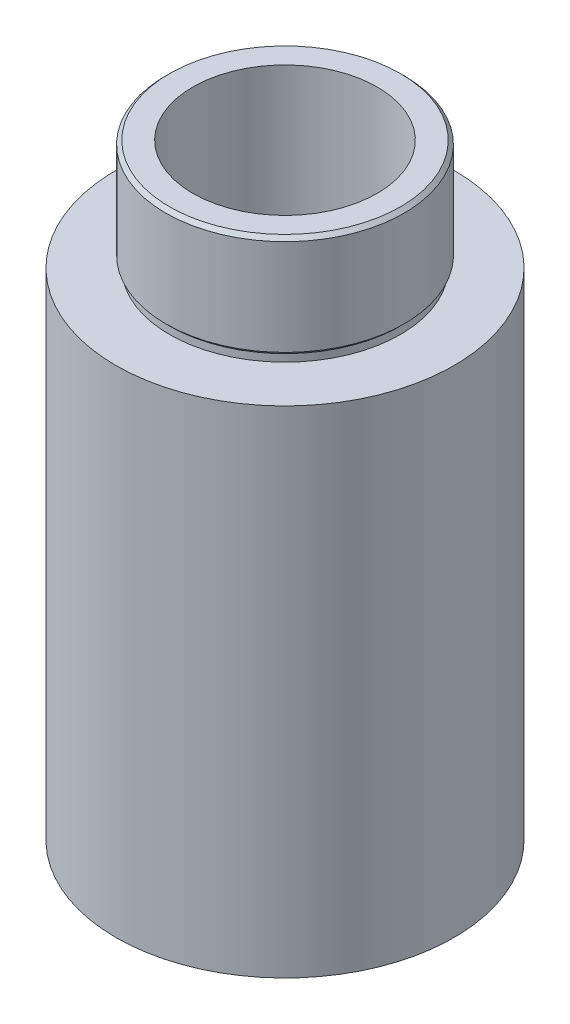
ISO-10303-21;
HEADER;
FILE_DESCRIPTION(('STEP AP214'),'2;1');
FILE_NAME('part.step','',(''),(''),'','','');
FILE_SCHEMA(('AUTOMOTIVE_DESIGN { 1 0 10303 214 1 1 1 1 }'));
ENDSEC;
DATA;
#1=APPLICATION_CONTEXT('core data for automotive mechanical design processes');
#2=APPLICATION_PROTOCOL_DEFINITION('international standard','automotive_design',2000,#1);
#3=PRODUCT_CONTEXT('',#1,'mechanical');
#4=PRODUCT('Part','Part','',(#3));
#5=PRODUCT_RELATED_PRODUCT_CATEGORY('part','',(#4));
#6=PRODUCT_DEFINITION_FORMATION('','',#4);
#7=PRODUCT_DEFINITION_CONTEXT('part definition',#1,'design');
#8=PRODUCT_DEFINITION('design','',#6,#7);
#9=PRODUCT_DEFINITION_SHAPE('','',#8);
#10=(LENGTH_UNIT() NAMED_UNIT(*) SI_UNIT(.MILLI.,.METRE.));
#11=(NAMED_UNIT(*) PLANE_ANGLE_UNIT() SI_UNIT($,.RADIAN.));
#12=(NAMED_UNIT(*) SI_UNIT($,.STERADIAN.) SOLID_ANGLE_UNIT());
#13=UNCERTAINTY_MEASURE_WITH_UNIT(LENGTH_MEASURE(1.E-05),#10,'distance_accuracy_value','');
#14=(GEOMETRIC_REPRESENTATION_CONTEXT(3) GLOBAL_UNCERTAINTY_ASSIGNED_CONTEXT((#13)) GLOBAL_UNIT_ASSIGNED_CONTEXT((#10,
#11,#12)) REPRESENTATION_CONTEXT('',''));
#15=CARTESIAN_POINT('',(0.,0.,0.));
#16=DIRECTION('',(0.,0.,1.));
#17=DIRECTION('',(1.,0.,0.));
#18=AXIS2_PLACEMENT_3D('',#15,#16,#17);
#19=CARTESIAN_POINT('',(41.6649122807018,222.25089122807,-1.8812569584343E-12));
#20=DIRECTION('',(0.,-1.,0.));
#21=DIRECTION('',(0.,0.,-1.));
#22=AXIS2_PLACEMENT_3D('',#19,#20,#21);
#23=CYLINDRICAL_SURFACE('',#22,10.795);
#24=CARTESIAN_POINT('',(41.6649122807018,227.73729122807,-1.8812569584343E-12));
#25=DIRECTION('',(0.,-1.,0.));
#26=DIRECTION('',(0.,0.,-1.));
#27=AXIS2_PLACEMENT_3D('',#24,#25,#26);
#28=CIRCLE('',#27,10.795);
#29=CARTESIAN_POINT('',(41.6649122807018,227.73729122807,-10.7950000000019));
#30=VERTEX_POINT('',#29);
#31=EDGE_CURVE('E77',#30,#30,#28,.T.);
#32=ORIENTED_EDGE('',*,*,#31,.T.);
#33=EDGE_LOOP('',(#32));
#34=FACE_BOUND('',#33,.T.);
#35=CARTESIAN_POINT('',(41.6649122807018,269.43774122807,-1.8812569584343E-12));
#36=DIRECTION('',(0.,1.,0.));
#37=DIRECTION('',(0.,0.,1.));
#38=AXIS2_PLACEMENT_3D('',#35,#36,#37);
#39=CIRCLE('',#38,10.795);
#40=CARTESIAN_POINT('',(41.6649122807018,269.43774122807,10.7949999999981));
#41=VERTEX_POINT('',#40);
#42=EDGE_CURVE('E107',#41,#41,#39,.F.);
#43=ORIENTED_EDGE('',*,*,#42,.F.);
#44=EDGE_LOOP('',(#43));
#45=FACE_BOUND('',#44,.T.);
#46=ADVANCED_FACE('F42',(#34,#45),#23,.F.);
#47=CARTESIAN_POINT('',(41.6649122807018,223.816525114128,-1.8812569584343E-12));
#48=DIRECTION('',(0.,-1.,0.));
#49=DIRECTION('',(0.,0.,-1.));
#50=AXIS2_PLACEMENT_3D('',#47,#48,#49);
#51=CONICAL_SURFACE('',#50,11.8455661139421,0.26179938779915);
#52=ORIENTED_EDGE('',*,*,#31,.F.);
#53=EDGE_LOOP('',(#52));
#54=FACE_BOUND('',#53,.T.);
#55=CARTESIAN_POINT('',(41.6649122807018,223.816525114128,-1.8812569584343E-12));
#56=DIRECTION('',(0.,-1.,0.));
#57=DIRECTION('',(0.,0.,-1.));
#58=AXIS2_PLACEMENT_3D('',#55,#56,#57);
#59=CIRCLE('',#58,11.8455661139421);
#60=CARTESIAN_POINT('',(41.6649122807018,223.816525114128,-11.845566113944));
#61=VERTEX_POINT('',#60);
#62=EDGE_CURVE('E84',#61,#61,#59,.T.);
#63=ORIENTED_EDGE('',*,*,#62,.T.);
#64=EDGE_LOOP('',(#63));
#65=FACE_BOUND('',#64,.T.);
#66=ADVANCED_FACE('F115',(#54,#65),#51,.F.);
#67=CARTESIAN_POINT('',(41.6649122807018,222.25089122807,-1.8812569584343E-12));
#68=DIRECTION('',(0.,-1.,0.));
#69=DIRECTION('',(0.,0.,-1.));
#70=AXIS2_PLACEMENT_3D('',#67,#68,#69);
#71=CONICAL_SURFACE('',#70,13.4112,0.78539816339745);
#72=ORIENTED_EDGE('',*,*,#62,.F.);
#73=EDGE_LOOP('',(#72));
#74=FACE_BOUND('',#73,.T.);
#75=CARTESIAN_POINT('',(41.6649122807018,222.25089122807,-1.8812569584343E-12));
#76=DIRECTION('',(0.,-1.,0.));
#77=DIRECTION('',(0.,0.,-1.));
#78=AXIS2_PLACEMENT_3D('',#75,#76,#77);
#79=CIRCLE('',#78,13.4112);
#80=CARTESIAN_POINT('',(41.6649122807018,222.25089122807,-13.4112000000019));
#81=VERTEX_POINT('',#80);
#82=EDGE_CURVE('E96',#81,#81,#79,.F.);
#83=ORIENTED_EDGE('',*,*,#82,.F.);
#84=EDGE_LOOP('',(#83));
#85=FACE_BOUND('',#84,.T.);
#86=ADVANCED_FACE('F121',(#74,#85),#71,.F.);
#87=CARTESIAN_POINT('',(41.6649122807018,222.25089122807,-1.8812569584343E-12));
#88=DIRECTION('',(0.,-1.,0.));
#89=DIRECTION('',(0.,0.,-1.));
#90=AXIS2_PLACEMENT_3D('',#87,#88,#89);
#91=PLANE('',#90);
#92=CARTESIAN_POINT('',(41.6649122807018,222.25089122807,-1.88258332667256E-12));
#93=DIRECTION('',(0.,-1.,0.));
#94=DIRECTION('',(0.,0.,-1.));
#95=AXIS2_PLACEMENT_3D('',#92,#93,#94);
#96=CIRCLE('',#95,14.0716);
#97=CARTESIAN_POINT('',(41.6649122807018,222.25089122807,-14.0716000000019));
#98=VERTEX_POINT('',#97);
#99=EDGE_CURVE('E100',#98,#98,#96,.F.);
#100=ORIENTED_EDGE('',*,*,#99,.F.);
#101=EDGE_LOOP('',(#100));
#102=FACE_BOUND('',#101,.T.);
#103=ORIENTED_EDGE('',*,*,#82,.T.);
#104=EDGE_LOOP('',(#103));
#105=FACE_BOUND('',#104,.T.);
#106=ADVANCED_FACE('F148',(#102,#105),#91,.T.);
#107=CARTESIAN_POINT('',(55.7365122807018,221.43174122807,-1.88258332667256E-12));
#108=DIRECTION('',(0.,1.,0.));
#109=DIRECTION('',(0.,0.,1.));
#110=AXIS2_PLACEMENT_3D('',#107,#108,#109);
#111=PLANE('',#110);
#112=CARTESIAN_POINT('',(41.6649122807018,221.43174122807,-1.88258332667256E-12));
#113=DIRECTION('',(0.,1.,0.));
#114=DIRECTION('',(0.,0.,1.));
#115=AXIS2_PLACEMENT_3D('',#112,#113,#114);
#116=CIRCLE('',#115,14.0716);
#117=CARTESIAN_POINT('',(41.6649122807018,221.43174122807,14.0715999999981));
#118=VERTEX_POINT('',#117);
#119=EDGE_CURVE('E92',#118,#118,#116,.T.);
#120=ORIENTED_EDGE('',*,*,#119,.T.);
#121=EDGE_LOOP('',(#120));
#122=FACE_BOUND('',#121,.T.);
#123=CARTESIAN_POINT('',(41.6649122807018,221.43174122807,-1.88258332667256E-12));
#124=DIRECTION('',(0.,1.,0.));
#125=DIRECTION('',(0.,0.,1.));
#126=AXIS2_PLACEMENT_3D('',#123,#124,#125);
#127=CIRCLE('',#126,17.4625);
#128=CARTESIAN_POINT('',(41.6649122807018,221.43174122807,17.4624999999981));
#129=VERTEX_POINT('',#128);
#130=EDGE_CURVE('E63',#129,#129,#127,.T.);
#131=ORIENTED_EDGE('',*,*,#130,.F.);
#132=EDGE_LOOP('',(#131));
#133=FACE_BOUND('',#132,.T.);
#134=ADVANCED_FACE('F145',(#122,#133),#111,.F.);
#135=CARTESIAN_POINT('',(41.6649122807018,302.710460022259,-1.88258332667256E-12));
#136=DIRECTION('',(0.,1.,0.));
#137=DIRECTION('',(0.,0.,1.));
#138=AXIS2_PLACEMENT_3D('',#135,#136,#137);
#139=CYLINDRICAL_SURFACE('',#138,17.4625);
#140=CARTESIAN_POINT('',(41.6649122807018,272.61274122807,-1.88258332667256E-12));
#141=DIRECTION('',(0.,1.,0.));
#142=DIRECTION('',(0.,0.,1.));
#143=AXIS2_PLACEMENT_3D('',#140,#141,#142);
#144=CIRCLE('',#143,17.4625);
#145=CARTESIAN_POINT('',(41.6649122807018,272.61274122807,17.4624999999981));
#146=VERTEX_POINT('',#145);
#147=EDGE_CURVE('E69',#146,#146,#144,.T.);
#148=ORIENTED_EDGE('',*,*,#147,.F.);
#149=EDGE_LOOP('',(#148));
#150=FACE_BOUND('',#149,.T.);
#151=ORIENTED_EDGE('',*,*,#130,.T.);
#152=EDGE_LOOP('',(#151));
#153=FACE_BOUND('',#152,.T.);
#154=ADVANCED_FACE('F141',(#150,#153),#139,.T.);
#155=CARTESIAN_POINT('',(56.6515399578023,272.61274122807,-1.88258332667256E-12));
#156=DIRECTION('',(0.,-1.,0.));
#157=DIRECTION('',(0.,0.,-1.));
#158=AXIS2_PLACEMENT_3D('',#155,#156,#157);
#159=PLANE('',#158);
#160=ORIENTED_EDGE('',*,*,#147,.T.);
#161=EDGE_LOOP('',(#160));
#162=FACE_BOUND('',#161,.T.);
#163=CARTESIAN_POINT('',(41.6649122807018,272.61274122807,-1.88258332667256E-12));
#164=DIRECTION('',(0.,1.,0.));
#165=DIRECTION('',(0.,0.,1.));
#166=AXIS2_PLACEMENT_3D('',#163,#164,#165);
#167=CIRCLE('',#166,11.9253);
#168=CARTESIAN_POINT('',(41.6649122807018,272.61274122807,-11.9253000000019));
#169=VERTEX_POINT('',#168);
#170=EDGE_CURVE('E73',#169,#169,#167,.T.);
#171=ORIENTED_EDGE('',*,*,#170,.F.);
#172=EDGE_LOOP('',(#171));
#173=FACE_BOUND('',#172,.T.);
#174=ADVANCED_FACE('F138',(#162,#173),#159,.F.);
#175=CARTESIAN_POINT('',(41.6649122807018,302.710460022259,-1.88258332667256E-12));
#176=DIRECTION('',(0.,1.,0.));
#177=DIRECTION('',(0.,0.,1.));
#178=AXIS2_PLACEMENT_3D('',#175,#176,#177);
#179=CYLINDRICAL_SURFACE('',#178,12.3063);
#180=CARTESIAN_POINT('',(41.6649122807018,283.66174122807,-1.88258332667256E-12));
#181=DIRECTION('',(0.,-1.,0.));
#182=DIRECTION('',(0.,0.,-1.));
#183=AXIS2_PLACEMENT_3D('',#180,#181,#182);
#184=CIRCLE('',#183,12.3063);
#185=CARTESIAN_POINT('',(41.6649122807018,283.66174122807,-12.3063000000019));
#186=VERTEX_POINT('',#185);
#187=EDGE_CURVE('E10',#186,#186,#184,.T.);
#188=ORIENTED_EDGE('',*,*,#187,.T.);
#189=EDGE_LOOP('',(#188));
#190=FACE_BOUND('',#189,.T.);
#191=CARTESIAN_POINT('',(41.6649122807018,273.75574122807,-1.88258332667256E-12));
#192=DIRECTION('',(0.,1.,0.));
#193=DIRECTION('',(0.,0.,1.));
#194=AXIS2_PLACEMENT_3D('',#191,#192,#193);
#195=CIRCLE('',#194,12.3063);
#196=CARTESIAN_POINT('',(41.6649122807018,273.75574122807,12.3062999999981));
#197=VERTEX_POINT('',#196);
#198=EDGE_CURVE('E50',#197,#197,#195,.T.);
#199=ORIENTED_EDGE('',*,*,#198,.T.);
#200=EDGE_LOOP('',(#199));
#201=FACE_BOUND('',#200,.T.);
#202=ADVANCED_FACE('F134',(#190,#201),#179,.T.);
#203=CARTESIAN_POINT('',(51.1899122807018,284.04274122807,-1.88258332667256E-12));
#204=DIRECTION('',(0.,-1.,0.));
#205=DIRECTION('',(0.,0.,-1.));
#206=AXIS2_PLACEMENT_3D('',#203,#204,#205);
#207=PLANE('',#206);
#208=CARTESIAN_POINT('',(41.6649122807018,284.04274122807,-1.88258332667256E-12));
#209=DIRECTION('',(0.,1.,0.));
#210=DIRECTION('',(0.,0.,1.));
#211=AXIS2_PLACEMENT_3D('',#208,#209,#210);
#212=CIRCLE('',#211,9.525);
#213=CARTESIAN_POINT('',(41.6649122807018,284.04274122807,9.52499999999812));
#214=VERTEX_POINT('',#213);
#215=EDGE_CURVE('E88',#214,#214,#212,.T.);
#216=ORIENTED_EDGE('',*,*,#215,.F.);
#217=EDGE_LOOP('',(#216));
#218=FACE_BOUND('',#217,.T.);
#219=CARTESIAN_POINT('',(41.6649122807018,284.04274122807,-1.88258332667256E-12));
#220=DIRECTION('',(0.,-1.,0.));
#221=DIRECTION('',(0.,0.,-1.));
#222=AXIS2_PLACEMENT_3D('',#219,#220,#221);
#223=CIRCLE('',#222,11.9253);
#224=CARTESIAN_POINT('',(41.6649122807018,284.04274122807,-11.9253000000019));
#225=VERTEX_POINT('',#224);
#226=EDGE_CURVE('E57',#225,#225,#223,.F.);
#227=ORIENTED_EDGE('',*,*,#226,.T.);
#228=EDGE_LOOP('',(#227));
#229=FACE_BOUND('',#228,.T.);
#230=ADVANCED_FACE('F130',(#218,#229),#207,.F.);
#231=CARTESIAN_POINT('',(41.6649122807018,273.37474122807,-1.88258332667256E-12));
#232=DIRECTION('',(0.,-1.,0.));
#233=DIRECTION('',(0.,0.,-1.));
#234=AXIS2_PLACEMENT_3D('',#231,#232,#233);
#235=CYLINDRICAL_SURFACE('',#234,11.9253);
#236=CARTESIAN_POINT('',(41.6649122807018,273.37474122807,-1.88258332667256E-12));
#237=DIRECTION('',(0.,1.,0.));
#238=DIRECTION('',(0.,0.,1.));
#239=AXIS2_PLACEMENT_3D('',#236,#237,#238);
#240=CIRCLE('',#239,11.9253);
#241=CARTESIAN_POINT('',(41.6649122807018,273.37474122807,-11.9253000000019));
#242=VERTEX_POINT('',#241);
#243=EDGE_CURVE('E72',#242,#242,#240,.T.);
#244=CARTESIAN_POINT('',(41.6649122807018,273.37474122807,-11.9253000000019));
#245=CARTESIAN_POINT('',(41.6649122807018,273.36680372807,-11.9253000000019));
#246=CARTESIAN_POINT('',(41.6649122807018,273.35886622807,-11.9253000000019));
#247=CARTESIAN_POINT('',(41.6649122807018,273.34299122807,-11.9253000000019));
#248=CARTESIAN_POINT('',(41.6649122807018,273.33505372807,-11.9253000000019));
#249=CARTESIAN_POINT('',(41.6649122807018,273.31917872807,-11.9253000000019));
#250=CARTESIAN_POINT('',(41.6649122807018,273.31124122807,-11.9253000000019));
#251=CARTESIAN_POINT('',(41.6649122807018,273.29536622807,-11.9253000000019));
#252=CARTESIAN_POINT('',(41.6649122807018,273.28742872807,-11.9253000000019));
#253=CARTESIAN_POINT('',(41.6649122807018,273.27155372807,-11.9253000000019));
#254=CARTESIAN_POINT('',(41.6649122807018,273.26361622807,-11.9253000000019));
#255=CARTESIAN_POINT('',(41.6649122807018,273.24774122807,-11.9253000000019));
#256=CARTESIAN_POINT('',(41.6649122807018,273.23980372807,-11.9253000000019));
#257=CARTESIAN_POINT('',(41.6649122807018,273.22392872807,-11.9253000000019));
#258=CARTESIAN_POINT('',(41.6649122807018,273.21599122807,-11.9253000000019));
#259=CARTESIAN_POINT('',(41.6649122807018,273.20011622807,-11.9253000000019));
#260=CARTESIAN_POINT('',(41.6649122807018,273.19217872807,-11.9253000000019));
#261=CARTESIAN_POINT('',(41.6649122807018,273.17630372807,-11.9253000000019));
#262=CARTESIAN_POINT('',(41.6649122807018,273.16836622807,-11.9253000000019));
#263=CARTESIAN_POINT('',(41.6649122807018,273.15249122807,-11.9253000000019));
#264=CARTESIAN_POINT('',(41.6649122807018,273.14455372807,-11.9253000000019));
#265=CARTESIAN_POINT('',(41.6649122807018,273.12867872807,-11.9253000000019));
#266=CARTESIAN_POINT('',(41.6649122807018,273.12074122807,-11.9253000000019));
#267=CARTESIAN_POINT('',(41.6649122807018,273.10486622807,-11.9253000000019));
#268=CARTESIAN_POINT('',(41.6649122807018,273.09692872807,-11.9253000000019));
#269=CARTESIAN_POINT('',(41.6649122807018,273.08105372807,-11.9253000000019));
#270=CARTESIAN_POINT('',(41.6649122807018,273.07311622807,-11.9253000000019));
#271=CARTESIAN_POINT('',(41.6649122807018,273.05724122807,-11.9253000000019));
#272=CARTESIAN_POINT('',(41.6649122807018,273.04930372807,-11.9253000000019));
#273=CARTESIAN_POINT('',(41.6649122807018,273.03342872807,-11.9253000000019));
#274=CARTESIAN_POINT('',(41.6649122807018,273.02549122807,-11.9253000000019));
#275=CARTESIAN_POINT('',(41.6649122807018,273.00961622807,-11.9253000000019));
#276=CARTESIAN_POINT('',(41.6649122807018,273.00167872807,-11.9253000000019));
#277=CARTESIAN_POINT('',(41.6649122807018,272.98580372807,-11.9253000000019));
#278=CARTESIAN_POINT('',(41.6649122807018,272.97786622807,-11.9253000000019));
#279=CARTESIAN_POINT('',(41.6649122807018,272.96199122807,-11.9253000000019));
#280=CARTESIAN_POINT('',(41.6649122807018,272.95405372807,-11.9253000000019));
#281=CARTESIAN_POINT('',(41.6649122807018,272.93817872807,-11.9253000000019));
#282=CARTESIAN_POINT('',(41.6649122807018,272.93024122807,-11.9253000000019));
#283=CARTESIAN_POINT('',(41.6649122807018,272.91436622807,-11.9253000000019));
#284=CARTESIAN_POINT('',(41.6649122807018,272.90642872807,-11.9253000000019));
#285=CARTESIAN_POINT('',(41.6649122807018,272.89055372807,-11.9253000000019));
#286=CARTESIAN_POINT('',(41.6649122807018,272.88261622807,-11.9253000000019));
#287=CARTESIAN_POINT('',(41.6649122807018,272.86674122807,-11.9253000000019));
#288=CARTESIAN_POINT('',(41.6649122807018,272.85880372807,-11.9253000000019));
#289=CARTESIAN_POINT('',(41.6649122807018,272.84292872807,-11.9253000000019));
#290=CARTESIAN_POINT('',(41.6649122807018,272.83499122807,-11.9253000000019));
#291=CARTESIAN_POINT('',(41.6649122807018,272.81911622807,-11.9253000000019));
#292=CARTESIAN_POINT('',(41.6649122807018,272.81117872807,-11.9253000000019));
#293=CARTESIAN_POINT('',(41.6649122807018,272.79530372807,-11.9253000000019));
#294=CARTESIAN_POINT('',(41.6649122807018,272.78736622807,-11.9253000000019));
#295=CARTESIAN_POINT('',(41.6649122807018,272.77149122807,-11.9253000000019));
#296=CARTESIAN_POINT('',(41.6649122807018,272.76355372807,-11.9253000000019));
#297=CARTESIAN_POINT('',(41.6649122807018,272.74767872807,-11.9253000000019));
#298=CARTESIAN_POINT('',(41.6649122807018,272.73974122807,-11.9253000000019));
#299=CARTESIAN_POINT('',(41.6649122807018,272.72386622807,-11.9253000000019));
#300=CARTESIAN_POINT('',(41.6649122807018,272.71592872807,-11.9253000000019));
#301=CARTESIAN_POINT('',(41.6649122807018,272.70005372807,-11.9253000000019));
#302=CARTESIAN_POINT('',(41.6649122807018,272.69211622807,-11.9253000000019));
#303=CARTESIAN_POINT('',(41.6649122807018,272.67624122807,-11.9253000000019));
#304=CARTESIAN_POINT('',(41.6649122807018,272.66830372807,-11.9253000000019));
#305=CARTESIAN_POINT('',(41.6649122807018,272.65242872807,-11.9253000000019));
#306=CARTESIAN_POINT('',(41.6649122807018,272.64449122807,-11.9253000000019));
#307=CARTESIAN_POINT('',(41.6649122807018,272.62861622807,-11.9253000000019));
#308=CARTESIAN_POINT('',(41.6649122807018,272.62067872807,-11.9253000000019));
#309=CARTESIAN_POINT('',(41.6649122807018,272.61274122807,-11.9253000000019));
#310=B_SPLINE_CURVE_WITH_KNOTS('',3,(#244,#245,#246,#247,#248,#249,#250,#251,#252,#253,#254,
#255,#256,#257,#258,#259,#260,#261,#262,#263,#264,#265,#266,#267,#268,#269,#270,#271,#272,#273,
#274,#275,#276,#277,#278,#279,#280,#281,#282,#283,#284,#285,#286,#287,#288,#289,#290,#291,#292,
#293,#294,#295,#296,#297,#298,#299,#300,#301,#302,#303,#304,#305,#306,#307,#308,#309),
.UNSPECIFIED.,.F.,.F.,(4,2,2,2,2,2,2,2,2,2,2,2,2,2,2,2,2,2,2,2,2,2,2,2,2,2,2,2,2,2,2,2,4),(0.,
0.0238124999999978,0.0476249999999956,0.0714374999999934,0.0952499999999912,0.119062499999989,
0.142874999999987,0.166687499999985,0.190499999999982,0.21431249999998,0.238124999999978,
0.261937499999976,0.285749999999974,0.309562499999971,0.333374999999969,0.357187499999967,
0.380999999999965,0.404812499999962,0.42862499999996,0.452437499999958,0.476249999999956,
0.500062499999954,0.523874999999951,0.547687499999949,0.571499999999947,0.595312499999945,
0.619124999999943,0.64293749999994,0.666749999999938,0.690562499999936,0.714374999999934,
0.738187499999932,0.761999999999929),.UNSPECIFIED.);
#311=EDGE_CURVE('BSEAM126',#242,#169,#310,.T.);
#312=ORIENTED_EDGE('',*,*,#243,.F.);
#313=ORIENTED_EDGE('',*,*,#170,.T.);
#314=ORIENTED_EDGE('',*,*,#311,.T.);
#315=ORIENTED_EDGE('',*,*,#311,.F.);
#316=EDGE_LOOP('',(#312,#314,#313,#315));
#317=FACE_BOUND('',#316,.T.);
#318=ADVANCED_FACE('F126',(#317),#235,.T.);
#319=CARTESIAN_POINT('',(41.6649122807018,284.04274122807,-1.88258332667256E-12));
#320=DIRECTION('',(0.,-1.,0.));
#321=DIRECTION('',(0.,0.,-1.));
#322=AXIS2_PLACEMENT_3D('',#319,#320,#321);
#323=CONICAL_SURFACE('',#322,11.9253,0.785398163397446);
#324=ORIENTED_EDGE('',*,*,#187,.F.);
#325=EDGE_LOOP('',(#324));
#326=FACE_BOUND('',#325,.T.);
#327=ORIENTED_EDGE('',*,*,#226,.F.);
#328=EDGE_LOOP('',(#327));
#329=FACE_BOUND('',#328,.T.);
#330=ADVANCED_FACE('F129',(#326,#329),#323,.T.);
#331=CARTESIAN_POINT('',(41.6649122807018,273.75574122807,-1.88258332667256E-12));
#332=DIRECTION('',(0.,1.,0.));
#333=DIRECTION('',(0.,0.,1.));
#334=AXIS2_PLACEMENT_3D('',#331,#332,#333);
#335=CONICAL_SURFACE('',#334,12.3063,0.785398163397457);
#336=ORIENTED_EDGE('',*,*,#243,.T.);
#337=EDGE_LOOP('',(#336));
#338=FACE_BOUND('',#337,.T.);
#339=ORIENTED_EDGE('',*,*,#198,.F.);
#340=EDGE_LOOP('',(#339));
#341=FACE_BOUND('',#340,.T.);
#342=ADVANCED_FACE('F44',(#338,#341),#335,.T.);
#343=CARTESIAN_POINT('',(41.6649122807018,302.710460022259,-1.88258332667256E-12));
#344=DIRECTION('',(0.,1.,0.));
#345=DIRECTION('',(0.,0.,1.));
#346=AXIS2_PLACEMENT_3D('',#343,#344,#345);
#347=CYLINDRICAL_SURFACE('',#346,9.525);
#348=CARTESIAN_POINT('',(41.6649122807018,269.43774122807,-1.88258332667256E-12));
#349=DIRECTION('',(0.,1.,0.));
#350=DIRECTION('',(0.,0.,1.));
#351=AXIS2_PLACEMENT_3D('',#348,#349,#350);
#352=CIRCLE('',#351,9.525);
#353=CARTESIAN_POINT('',(41.6649122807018,269.43774122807,9.52499999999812));
#354=VERTEX_POINT('',#353);
#355=EDGE_CURVE('E103',#354,#354,#352,.F.);
#356=ORIENTED_EDGE('',*,*,#355,.T.);
#357=EDGE_LOOP('',(#356));
#358=FACE_BOUND('',#357,.T.);
#359=ORIENTED_EDGE('',*,*,#215,.T.);
#360=EDGE_LOOP('',(#359));
#361=FACE_BOUND('',#360,.T.);
#362=ADVANCED_FACE('F155',(#358,#361),#347,.F.);
#363=CARTESIAN_POINT('',(41.6649122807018,302.710460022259,-1.88258332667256E-12));
#364=DIRECTION('',(0.,1.,0.));
#365=DIRECTION('',(0.,0.,1.));
#366=AXIS2_PLACEMENT_3D('',#363,#364,#365);
#367=CYLINDRICAL_SURFACE('',#366,14.0716);
#368=ORIENTED_EDGE('',*,*,#119,.F.);
#369=EDGE_LOOP('',(#368));
#370=FACE_BOUND('',#369,.T.);
#371=ORIENTED_EDGE('',*,*,#99,.T.);
#372=EDGE_LOOP('',(#371));
#373=FACE_BOUND('',#372,.T.);
#374=ADVANCED_FACE('F163',(#370,#373),#367,.F.);
#375=CARTESIAN_POINT('',(41.6649122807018,269.43774122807,-1.88258332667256E-12));
#376=DIRECTION('',(0.,1.,0.));
#377=DIRECTION('',(0.,0.,1.));
#378=AXIS2_PLACEMENT_3D('',#375,#376,#377);
#379=PLANE('',#378);
#380=ORIENTED_EDGE('',*,*,#42,.T.);
#381=EDGE_LOOP('',(#380));
#382=FACE_BOUND('',#381,.T.);
#383=ORIENTED_EDGE('',*,*,#355,.F.);
#384=EDGE_LOOP('',(#383));
#385=FACE_BOUND('',#384,.T.);
#386=ADVANCED_FACE('F111',(#382,#385),#379,.F.);
#387=CLOSED_SHELL('',(#46,#66,#86,#106,#134,#154,#174,#202,#230,#318,#330,#342,#362,#374,#386));
#388=MANIFOLD_SOLID_BREP('B2',#387);
#389=ADVANCED_BREP_SHAPE_REPRESENTATION('',(#18,#388),#14);
#390=SHAPE_DEFINITION_REPRESENTATION(#9,#389);
ENDSEC;
END-ISO-10303-21;
